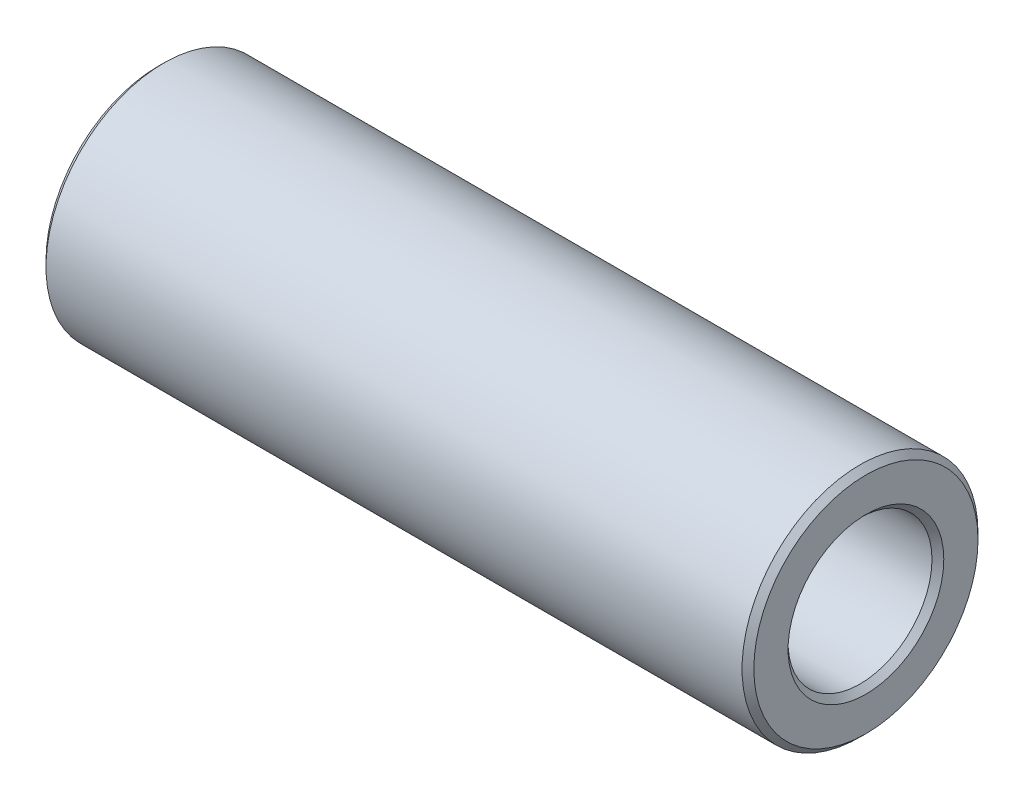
ISO-10303-21;
HEADER;
FILE_DESCRIPTION(('STEP AP214'),'2;1');
FILE_NAME('part.step','',(''),(''),'','','');
FILE_SCHEMA(('AUTOMOTIVE_DESIGN { 1 0 10303 214 1 1 1 1 }'));
ENDSEC;
DATA;
#1=APPLICATION_CONTEXT('core data for automotive mechanical design processes');
#2=APPLICATION_PROTOCOL_DEFINITION('international standard','automotive_design',2000,#1);
#3=PRODUCT_CONTEXT('',#1,'mechanical');
#4=PRODUCT('Part','Part','',(#3));
#5=PRODUCT_RELATED_PRODUCT_CATEGORY('part','',(#4));
#6=PRODUCT_DEFINITION_FORMATION('','',#4);
#7=PRODUCT_DEFINITION_CONTEXT('part definition',#1,'design');
#8=PRODUCT_DEFINITION('design','',#6,#7);
#9=PRODUCT_DEFINITION_SHAPE('','',#8);
#10=(LENGTH_UNIT() NAMED_UNIT(*) SI_UNIT(.MILLI.,.METRE.));
#11=(NAMED_UNIT(*) PLANE_ANGLE_UNIT() SI_UNIT($,.RADIAN.));
#12=(NAMED_UNIT(*) SI_UNIT($,.STERADIAN.) SOLID_ANGLE_UNIT());
#13=UNCERTAINTY_MEASURE_WITH_UNIT(LENGTH_MEASURE(1.E-05),#10,'distance_accuracy_value','');
#14=(GEOMETRIC_REPRESENTATION_CONTEXT(3) GLOBAL_UNCERTAINTY_ASSIGNED_CONTEXT((#13)) GLOBAL_UNIT_ASSIGNED_CONTEXT((#10,
#11,#12)) REPRESENTATION_CONTEXT('',''));
#15=CARTESIAN_POINT('',(0.,0.,0.));
#16=DIRECTION('',(0.,0.,1.));
#17=DIRECTION('',(1.,0.,0.));
#18=AXIS2_PLACEMENT_3D('',#15,#16,#17);
#19=CARTESIAN_POINT('',(30.,0.,0.));
#20=DIRECTION('',(1.,0.,0.));
#21=DIRECTION('',(0.,0.,-1.));
#22=AXIS2_PLACEMENT_3D('',#19,#20,#21);
#23=PLANE('',#22);
#24=CARTESIAN_POINT('',(30.,0.,0.));
#25=DIRECTION('',(1.,0.,0.));
#26=DIRECTION('',(0.,0.,-1.));
#27=AXIS2_PLACEMENT_3D('',#24,#25,#26);
#28=CIRCLE('',#27,3.3);
#29=CARTESIAN_POINT('',(30.,0.,-3.3));
#30=VERTEX_POINT('',#29);
#31=EDGE_CURVE('E40',#30,#30,#28,.F.);
#32=ORIENTED_EDGE('',*,*,#31,.T.);
#33=EDGE_LOOP('',(#32));
#34=FACE_BOUND('',#33,.T.);
#35=CARTESIAN_POINT('',(30.,0.,0.));
#36=DIRECTION('',(1.,0.,0.));
#37=DIRECTION('',(0.,0.,-1.));
#38=AXIS2_PLACEMENT_3D('',#35,#36,#37);
#39=CIRCLE('',#38,4.75000000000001);
#40=CARTESIAN_POINT('',(30.,0.,-4.75000000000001));
#41=VERTEX_POINT('',#40);
#42=EDGE_CURVE('E44',#41,#41,#39,.T.);
#43=ORIENTED_EDGE('',*,*,#42,.T.);
#44=EDGE_LOOP('',(#43));
#45=FACE_BOUND('',#44,.T.);
#46=ADVANCED_FACE('F29',(#34,#45),#23,.T.);
#47=CARTESIAN_POINT('',(0.,0.,0.));
#48=DIRECTION('',(1.,0.,0.));
#49=DIRECTION('',(0.,0.,-1.));
#50=AXIS2_PLACEMENT_3D('',#47,#48,#49);
#51=PLANE('',#50);
#52=CARTESIAN_POINT('',(0.,0.,0.));
#53=DIRECTION('',(1.,0.,0.));
#54=DIRECTION('',(0.,0.,-1.));
#55=AXIS2_PLACEMENT_3D('',#52,#53,#54);
#56=CIRCLE('',#55,3.3);
#57=CARTESIAN_POINT('',(0.,0.,-3.3));
#58=VERTEX_POINT('',#57);
#59=EDGE_CURVE('E55',#58,#58,#56,.T.);
#60=ORIENTED_EDGE('',*,*,#59,.T.);
#61=EDGE_LOOP('',(#60));
#62=FACE_BOUND('',#61,.T.);
#63=CARTESIAN_POINT('',(0.,0.,0.));
#64=DIRECTION('',(1.,0.,0.));
#65=DIRECTION('',(0.,0.,-1.));
#66=AXIS2_PLACEMENT_3D('',#63,#64,#65);
#67=CIRCLE('',#66,4.75);
#68=CARTESIAN_POINT('',(0.,0.,-4.75));
#69=VERTEX_POINT('',#68);
#70=EDGE_CURVE('E58',#69,#69,#67,.F.);
#71=ORIENTED_EDGE('',*,*,#70,.T.);
#72=EDGE_LOOP('',(#71));
#73=FACE_BOUND('',#72,.T.);
#74=ADVANCED_FACE('F62',(#62,#73),#51,.F.);
#75=CARTESIAN_POINT('',(30.,0.,0.));
#76=DIRECTION('',(-1.,0.,0.));
#77=DIRECTION('',(0.,0.,1.));
#78=AXIS2_PLACEMENT_3D('',#75,#76,#77);
#79=CYLINDRICAL_SURFACE('',#78,5.);
#80=CARTESIAN_POINT('',(0.25,0.,0.));
#81=DIRECTION('',(1.,0.,0.));
#82=DIRECTION('',(0.,0.,-1.));
#83=AXIS2_PLACEMENT_3D('',#80,#81,#82);
#84=CIRCLE('',#83,5.);
#85=CARTESIAN_POINT('',(0.25,0.,-5.));
#86=VERTEX_POINT('',#85);
#87=EDGE_CURVE('E10',#86,#86,#84,.T.);
#88=ORIENTED_EDGE('',*,*,#87,.T.);
#89=EDGE_LOOP('',(#88));
#90=FACE_BOUND('',#89,.T.);
#91=CARTESIAN_POINT('',(29.75,0.,0.));
#92=DIRECTION('',(1.,0.,0.));
#93=DIRECTION('',(0.,0.,-1.));
#94=AXIS2_PLACEMENT_3D('',#91,#92,#93);
#95=CIRCLE('',#94,5.);
#96=CARTESIAN_POINT('',(29.75,0.,-5.));
#97=VERTEX_POINT('',#96);
#98=EDGE_CURVE('E36',#97,#97,#95,.F.);
#99=ORIENTED_EDGE('',*,*,#98,.T.);
#100=EDGE_LOOP('',(#99));
#101=FACE_BOUND('',#100,.T.);
#102=ADVANCED_FACE('F82',(#90,#101),#79,.T.);
#103=CARTESIAN_POINT('',(30.,0.,0.));
#104=DIRECTION('',(-1.,0.,0.));
#105=DIRECTION('',(0.,0.,1.));
#106=AXIS2_PLACEMENT_3D('',#103,#104,#105);
#107=CYLINDRICAL_SURFACE('',#106,3.05);
#108=CARTESIAN_POINT('',(0.249999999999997,0.,0.));
#109=DIRECTION('',(1.,0.,0.));
#110=DIRECTION('',(0.,0.,-1.));
#111=AXIS2_PLACEMENT_3D('',#108,#109,#110);
#112=CIRCLE('',#111,3.05);
#113=CARTESIAN_POINT('',(0.249999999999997,0.,-3.05));
#114=VERTEX_POINT('',#113);
#115=EDGE_CURVE('E49',#114,#114,#112,.F.);
#116=ORIENTED_EDGE('',*,*,#115,.T.);
#117=EDGE_LOOP('',(#116));
#118=FACE_BOUND('',#117,.T.);
#119=CARTESIAN_POINT('',(29.75,0.,0.));
#120=DIRECTION('',(1.,0.,0.));
#121=DIRECTION('',(0.,0.,-1.));
#122=AXIS2_PLACEMENT_3D('',#119,#120,#121);
#123=CIRCLE('',#122,3.05);
#124=CARTESIAN_POINT('',(29.75,0.,-3.05));
#125=VERTEX_POINT('',#124);
#126=EDGE_CURVE('E52',#125,#125,#123,.T.);
#127=ORIENTED_EDGE('',*,*,#126,.T.);
#128=EDGE_LOOP('',(#127));
#129=FACE_BOUND('',#128,.T.);
#130=ADVANCED_FACE('F87',(#118,#129),#107,.F.);
#131=CARTESIAN_POINT('',(0.,0.,0.));
#132=DIRECTION('',(-1.,0.,0.));
#133=DIRECTION('',(0.,0.,1.));
#134=AXIS2_PLACEMENT_3D('',#131,#132,#133);
#135=CONICAL_SURFACE('',#134,3.3,0.78539816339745);
#136=ORIENTED_EDGE('',*,*,#115,.F.);
#137=EDGE_LOOP('',(#136));
#138=FACE_BOUND('',#137,.T.);
#139=ORIENTED_EDGE('',*,*,#59,.F.);
#140=EDGE_LOOP('',(#139));
#141=FACE_BOUND('',#140,.T.);
#142=ADVANCED_FACE('F73',(#138,#141),#135,.F.);
#143=CARTESIAN_POINT('',(29.75,0.,0.));
#144=DIRECTION('',(1.,0.,0.));
#145=DIRECTION('',(0.,0.,-1.));
#146=AXIS2_PLACEMENT_3D('',#143,#144,#145);
#147=CONICAL_SURFACE('',#146,3.05,0.78539816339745);
#148=ORIENTED_EDGE('',*,*,#31,.F.);
#149=EDGE_LOOP('',(#148));
#150=FACE_BOUND('',#149,.T.);
#151=ORIENTED_EDGE('',*,*,#126,.F.);
#152=EDGE_LOOP('',(#151));
#153=FACE_BOUND('',#152,.T.);
#154=ADVANCED_FACE('F67',(#150,#153),#147,.F.);
#155=CARTESIAN_POINT('',(0.25,0.,0.));
#156=DIRECTION('',(1.,0.,0.));
#157=DIRECTION('',(0.,0.,-1.));
#158=AXIS2_PLACEMENT_3D('',#155,#156,#157);
#159=CONICAL_SURFACE('',#158,5.,0.785398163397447);
#160=ORIENTED_EDGE('',*,*,#70,.F.);
#161=EDGE_LOOP('',(#160));
#162=FACE_BOUND('',#161,.T.);
#163=ORIENTED_EDGE('',*,*,#87,.F.);
#164=EDGE_LOOP('',(#163));
#165=FACE_BOUND('',#164,.T.);
#166=ADVANCED_FACE('F64',(#162,#165),#159,.T.);
#167=CARTESIAN_POINT('',(30.,0.,0.));
#168=DIRECTION('',(-1.,0.,0.));
#169=DIRECTION('',(0.,0.,1.));
#170=AXIS2_PLACEMENT_3D('',#167,#168,#169);
#171=CONICAL_SURFACE('',#170,4.75000000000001,0.78539816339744);
#172=ORIENTED_EDGE('',*,*,#98,.F.);
#173=EDGE_LOOP('',(#172));
#174=FACE_BOUND('',#173,.T.);
#175=ORIENTED_EDGE('',*,*,#42,.F.);
#176=EDGE_LOOP('',(#175));
#177=FACE_BOUND('',#176,.T.);
#178=ADVANCED_FACE('F31',(#174,#177),#171,.T.);
#179=CLOSED_SHELL('',(#46,#74,#102,#130,#142,#154,#166,#178));
#180=MANIFOLD_SOLID_BREP('B2',#179);
#181=ADVANCED_BREP_SHAPE_REPRESENTATION('',(#18,#180),#14);
#182=SHAPE_DEFINITION_REPRESENTATION(#9,#181);
ENDSEC;
END-ISO-10303-21;
